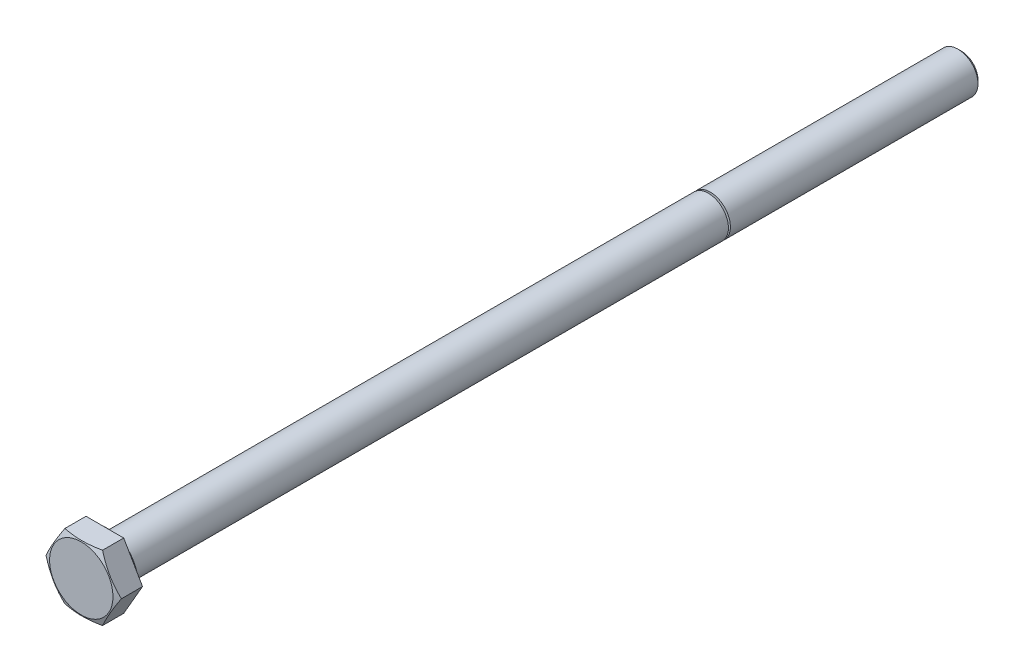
ISO-10303-21;
HEADER;
FILE_DESCRIPTION(('STEP AP214'),'2;1');
FILE_NAME('part.step','',(''),(''),'','','');
FILE_SCHEMA(('AUTOMOTIVE_DESIGN { 1 0 10303 214 1 1 1 1 }'));
ENDSEC;
DATA;
#1=APPLICATION_CONTEXT('core data for automotive mechanical design processes');
#2=APPLICATION_PROTOCOL_DEFINITION('international standard','automotive_design',2000,#1);
#3=PRODUCT_CONTEXT('',#1,'mechanical');
#4=PRODUCT('Part','Part','',(#3));
#5=PRODUCT_RELATED_PRODUCT_CATEGORY('part','',(#4));
#6=PRODUCT_DEFINITION_FORMATION('','',#4);
#7=PRODUCT_DEFINITION_CONTEXT('part definition',#1,'design');
#8=PRODUCT_DEFINITION('design','',#6,#7);
#9=PRODUCT_DEFINITION_SHAPE('','',#8);
#10=(LENGTH_UNIT() NAMED_UNIT(*) SI_UNIT(.MILLI.,.METRE.));
#11=(NAMED_UNIT(*) PLANE_ANGLE_UNIT() SI_UNIT($,.RADIAN.));
#12=(NAMED_UNIT(*) SI_UNIT($,.STERADIAN.) SOLID_ANGLE_UNIT());
#13=UNCERTAINTY_MEASURE_WITH_UNIT(LENGTH_MEASURE(1.E-05),#10,'distance_accuracy_value','');
#14=(GEOMETRIC_REPRESENTATION_CONTEXT(3) GLOBAL_UNCERTAINTY_ASSIGNED_CONTEXT((#13)) GLOBAL_UNIT_ASSIGNED_CONTEXT((#10,
#11,#12)) REPRESENTATION_CONTEXT('',''));
#15=CARTESIAN_POINT('',(0.,0.,0.));
#16=DIRECTION('',(0.,0.,1.));
#17=DIRECTION('',(1.,0.,0.));
#18=AXIS2_PLACEMENT_3D('',#15,#16,#17);
#19=CARTESIAN_POINT('',(0.,6.3,0.6));
#20=DIRECTION('',(0.,0.,1.));
#21=DIRECTION('',(1.,0.,0.));
#22=AXIS2_PLACEMENT_3D('',#19,#20,#21);
#23=PLANE('',#22);
#24=CARTESIAN_POINT('',(0.,0.,0.6));
#25=DIRECTION('',(0.,0.,1.));
#26=DIRECTION('',(1.,0.,0.));
#27=AXIS2_PLACEMENT_3D('',#24,#25,#26);
#28=CIRCLE('',#27,6.3);
#29=CARTESIAN_POINT('',(6.3,0.,0.6));
#30=VERTEX_POINT('',#29);
#31=EDGE_CURVE('E229',#30,#30,#28,.T.);
#32=ORIENTED_EDGE('',*,*,#31,.T.);
#33=EDGE_LOOP('',(#32));
#34=FACE_BOUND('',#33,.T.);
#35=DIRECTION('',(-1.,0.,0.));
#36=VECTOR('',#35,1.);
#37=CARTESIAN_POINT('',(0.,-6.49999696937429,0.6));
#38=LINE('',#37,#36);
#39=CARTESIAN_POINT('',(3.752775,-6.49999696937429,0.600000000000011));
#40=VERTEX_POINT('',#39);
#41=CARTESIAN_POINT('',(-3.752775,-6.4999969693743,0.6));
#42=VERTEX_POINT('',#41);
#43=EDGE_CURVE('E215',#40,#42,#38,.T.);
#44=ORIENTED_EDGE('',*,*,#43,.T.);
#45=DIRECTION('',(-0.5,0.866025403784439,0.));
#46=VECTOR('',#45,1.);
#47=CARTESIAN_POINT('',(-8.35714252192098,1.47500151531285,0.6));
#48=LINE('',#47,#46);
#49=CARTESIAN_POINT('',(-7.50555,0.,0.60000000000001));
#50=VERTEX_POINT('',#49);
#51=EDGE_CURVE('E84',#42,#50,#48,.T.);
#52=ORIENTED_EDGE('',*,*,#51,.T.);
#53=DIRECTION('',(0.5,0.866025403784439,0.));
#54=VECTOR('',#53,1.);
#55=CARTESIAN_POINT('',(-2.90118247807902,7.97499848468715,0.6));
#56=LINE('',#55,#54);
#57=CARTESIAN_POINT('',(-3.752775,6.49999696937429,0.600000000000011));
#58=VERTEX_POINT('',#57);
#59=EDGE_CURVE('E223',#50,#58,#56,.T.);
#60=ORIENTED_EDGE('',*,*,#59,.T.);
#61=DIRECTION('',(1.,0.,0.));
#62=VECTOR('',#61,1.);
#63=CARTESIAN_POINT('',(0.,6.4999969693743,0.6));
#64=LINE('',#63,#62);
#65=CARTESIAN_POINT('',(3.752775,6.4999969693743,0.600000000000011));
#66=VERTEX_POINT('',#65);
#67=EDGE_CURVE('E220',#58,#66,#64,.T.);
#68=ORIENTED_EDGE('',*,*,#67,.T.);
#69=DIRECTION('',(0.5,-0.866025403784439,0.));
#70=VECTOR('',#69,1.);
#71=CARTESIAN_POINT('',(2.90118247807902,7.97499848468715,0.6));
#72=LINE('',#71,#70);
#73=CARTESIAN_POINT('',(7.50555,0.,0.600000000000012));
#74=VERTEX_POINT('',#73);
#75=EDGE_CURVE('E218',#66,#74,#72,.T.);
#76=ORIENTED_EDGE('',*,*,#75,.T.);
#77=DIRECTION('',(-0.5,-0.866025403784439,0.));
#78=VECTOR('',#77,1.);
#79=CARTESIAN_POINT('',(8.35714252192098,1.47500151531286,0.6));
#80=LINE('',#79,#78);
#81=EDGE_CURVE('E203',#74,#40,#80,.T.);
#82=ORIENTED_EDGE('',*,*,#81,.T.);
#83=EDGE_LOOP('',(#44,#52,#60,#68,#76,#82));
#84=FACE_BOUND('',#83,.T.);
#85=ADVANCED_FACE('F17',(#34,#84),#23,.F.);
#86=CARTESIAN_POINT('',(0.,0.,-170.));
#87=DIRECTION('',(0.,0.,1.));
#88=DIRECTION('',(1.,0.,0.));
#89=AXIS2_PLACEMENT_3D('',#86,#87,#88);
#90=PLANE('',#89);
#91=CARTESIAN_POINT('',(0.,0.,-170.));
#92=DIRECTION('',(0.,0.,1.));
#93=DIRECTION('',(1.,0.,0.));
#94=AXIS2_PLACEMENT_3D('',#91,#92,#93);
#95=CIRCLE('',#94,3.3234375);
#96=CARTESIAN_POINT('',(3.32343750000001,0.,-170.));
#97=VERTEX_POINT('',#96);
#98=EDGE_CURVE('E77',#97,#97,#95,.T.);
#99=ORIENTED_EDGE('',*,*,#98,.F.);
#100=EDGE_LOOP('',(#99));
#101=FACE_BOUND('',#100,.T.);
#102=ADVANCED_FACE('F19',(#101),#90,.F.);
#103=CARTESIAN_POINT('',(0.,0.,-170.));
#104=DIRECTION('',(0.,0.,1.));
#105=DIRECTION('',(1.,0.,0.));
#106=AXIS2_PLACEMENT_3D('',#103,#104,#105);
#107=CONICAL_SURFACE('',#106,3.3234375,0.785398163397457);
#108=CARTESIAN_POINT('',(0.,0.,-169.3234375));
#109=DIRECTION('',(0.,0.,1.));
#110=DIRECTION('',(1.,0.,0.));
#111=AXIS2_PLACEMENT_3D('',#108,#109,#110);
#112=CIRCLE('',#111,4.);
#113=CARTESIAN_POINT('',(4.00000000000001,0.,-169.3234375));
#114=VERTEX_POINT('',#113);
#115=EDGE_CURVE('E173',#114,#114,#112,.T.);
#116=ORIENTED_EDGE('',*,*,#115,.F.);
#117=EDGE_LOOP('',(#116));
#118=FACE_BOUND('',#117,.T.);
#119=ORIENTED_EDGE('',*,*,#98,.T.);
#120=EDGE_LOOP('',(#119));
#121=FACE_BOUND('',#120,.T.);
#122=ADVANCED_FACE('F135',(#118,#121),#107,.T.);
#123=CARTESIAN_POINT('',(0.,0.,5.3));
#124=DIRECTION('',(0.,0.,1.));
#125=DIRECTION('',(1.,0.,0.));
#126=AXIS2_PLACEMENT_3D('',#123,#124,#125);
#127=CYLINDRICAL_SURFACE('',#126,4.);
#128=CARTESIAN_POINT('',(0.,0.,-120.));
#129=DIRECTION('',(0.,0.,1.));
#130=DIRECTION('',(1.,0.,0.));
#131=AXIS2_PLACEMENT_3D('',#128,#129,#130);
#132=CIRCLE('',#131,4.);
#133=CARTESIAN_POINT('',(4.00000000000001,0.,-120.));
#134=VERTEX_POINT('',#133);
#135=EDGE_CURVE('E177',#134,#134,#132,.T.);
#136=ORIENTED_EDGE('',*,*,#135,.F.);
#137=EDGE_LOOP('',(#136));
#138=FACE_BOUND('',#137,.T.);
#139=ORIENTED_EDGE('',*,*,#115,.T.);
#140=EDGE_LOOP('',(#139));
#141=FACE_BOUND('',#140,.T.);
#142=ADVANCED_FACE('F162',(#138,#141),#127,.T.);
#143=CARTESIAN_POINT('',(0.,4.,-120.));
#144=DIRECTION('',(0.,0.,-1.));
#145=DIRECTION('',(-1.,0.,0.));
#146=AXIS2_PLACEMENT_3D('',#143,#144,#145);
#147=PLANE('',#146);
#148=CARTESIAN_POINT('',(0.,0.,-120.));
#149=DIRECTION('',(0.,0.,1.));
#150=DIRECTION('',(1.,0.,0.));
#151=AXIS2_PLACEMENT_3D('',#148,#149,#150);
#152=CIRCLE('',#151,3.3234375);
#153=CARTESIAN_POINT('',(3.32343750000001,0.,-120.));
#154=VERTEX_POINT('',#153);
#155=EDGE_CURVE('E243',#154,#154,#152,.T.);
#156=ORIENTED_EDGE('',*,*,#155,.F.);
#157=EDGE_LOOP('',(#156));
#158=FACE_BOUND('',#157,.T.);
#159=ORIENTED_EDGE('',*,*,#135,.T.);
#160=EDGE_LOOP('',(#159));
#161=FACE_BOUND('',#160,.T.);
#162=ADVANCED_FACE('F158',(#158,#161),#147,.F.);
#163=CARTESIAN_POINT('',(0.,0.,-120.));
#164=DIRECTION('',(0.,0.,1.));
#165=DIRECTION('',(1.,0.,0.));
#166=AXIS2_PLACEMENT_3D('',#163,#164,#165);
#167=CONICAL_SURFACE('',#166,3.3234375,1.04719755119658);
#168=CARTESIAN_POINT('',(0.,0.,-119.609386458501));
#169=DIRECTION('',(0.,0.,1.));
#170=DIRECTION('',(1.,0.,0.));
#171=AXIS2_PLACEMENT_3D('',#168,#169,#170);
#172=CIRCLE('',#171,4.);
#173=CARTESIAN_POINT('',(4.00000000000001,0.,-119.609386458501));
#174=VERTEX_POINT('',#173);
#175=EDGE_CURVE('E240',#174,#174,#172,.T.);
#176=ORIENTED_EDGE('',*,*,#175,.F.);
#177=EDGE_LOOP('',(#176));
#178=FACE_BOUND('',#177,.T.);
#179=ORIENTED_EDGE('',*,*,#155,.T.);
#180=EDGE_LOOP('',(#179));
#181=FACE_BOUND('',#180,.T.);
#182=ADVANCED_FACE('F154',(#178,#181),#167,.T.);
#183=CARTESIAN_POINT('',(0.,0.,5.3));
#184=DIRECTION('',(0.,0.,1.));
#185=DIRECTION('',(1.,0.,0.));
#186=AXIS2_PLACEMENT_3D('',#183,#184,#185);
#187=CYLINDRICAL_SURFACE('',#186,4.);
#188=CARTESIAN_POINT('',(0.,0.,-0.4));
#189=DIRECTION('',(0.,0.,1.));
#190=DIRECTION('',(1.,0.,0.));
#191=AXIS2_PLACEMENT_3D('',#188,#189,#190);
#192=CIRCLE('',#191,4.);
#193=CARTESIAN_POINT('',(4.,0.,-0.4));
#194=VERTEX_POINT('',#193);
#195=EDGE_CURVE('E237',#194,#194,#192,.T.);
#196=ORIENTED_EDGE('',*,*,#195,.F.);
#197=EDGE_LOOP('',(#196));
#198=FACE_BOUND('',#197,.T.);
#199=ORIENTED_EDGE('',*,*,#175,.T.);
#200=EDGE_LOOP('',(#199));
#201=FACE_BOUND('',#200,.T.);
#202=ADVANCED_FACE('F150',(#198,#201),#187,.T.);
#203=CARTESIAN_POINT('',(0.,0.,-0.4));
#204=DIRECTION('',(0.,0.,1.));
#205=DIRECTION('',(1.,0.,0.));
#206=AXIS2_PLACEMENT_3D('',#203,#204,#205);
#207=TOROIDAL_SURFACE('',#206,4.4,0.4);
#208=ORIENTED_EDGE('',*,*,#195,.T.);
#209=EDGE_LOOP('',(#208));
#210=FACE_BOUND('',#209,.T.);
#211=CARTESIAN_POINT('',(0.,0.,0.));
#212=DIRECTION('',(0.,0.,1.));
#213=DIRECTION('',(1.,0.,0.));
#214=AXIS2_PLACEMENT_3D('',#211,#212,#213);
#215=CIRCLE('',#214,4.4);
#216=CARTESIAN_POINT('',(4.4,0.,0.));
#217=VERTEX_POINT('',#216);
#218=EDGE_CURVE('E234',#217,#217,#215,.T.);
#219=ORIENTED_EDGE('',*,*,#218,.F.);
#220=EDGE_LOOP('',(#219));
#221=FACE_BOUND('',#220,.T.);
#222=ADVANCED_FACE('F146',(#210,#221),#207,.F.);
#223=CARTESIAN_POINT('',(0.,4.4,0.));
#224=DIRECTION('',(0.,0.,1.));
#225=DIRECTION('',(1.,0.,0.));
#226=AXIS2_PLACEMENT_3D('',#223,#224,#225);
#227=PLANE('',#226);
#228=CARTESIAN_POINT('',(0.,0.,0.));
#229=DIRECTION('',(0.,0.,1.));
#230=DIRECTION('',(1.,0.,0.));
#231=AXIS2_PLACEMENT_3D('',#228,#229,#230);
#232=CIRCLE('',#231,5.7);
#233=CARTESIAN_POINT('',(5.7,0.,0.));
#234=VERTEX_POINT('',#233);
#235=EDGE_CURVE('E231',#234,#234,#232,.T.);
#236=ORIENTED_EDGE('',*,*,#235,.F.);
#237=EDGE_LOOP('',(#236));
#238=FACE_BOUND('',#237,.T.);
#239=ORIENTED_EDGE('',*,*,#218,.T.);
#240=EDGE_LOOP('',(#239));
#241=FACE_BOUND('',#240,.T.);
#242=ADVANCED_FACE('F142',(#238,#241),#227,.F.);
#243=CARTESIAN_POINT('',(0.,0.,0.6));
#244=DIRECTION('',(0.,0.,1.));
#245=DIRECTION('',(1.,0.,0.));
#246=AXIS2_PLACEMENT_3D('',#243,#244,#245);
#247=TOROIDAL_SURFACE('',#246,5.7,0.6);
#248=ORIENTED_EDGE('',*,*,#31,.F.);
#249=EDGE_LOOP('',(#248));
#250=FACE_BOUND('',#249,.T.);
#251=ORIENTED_EDGE('',*,*,#235,.T.);
#252=EDGE_LOOP('',(#251));
#253=FACE_BOUND('',#252,.T.);
#254=ADVANCED_FACE('F117',(#250,#253),#247,.T.);
#255=CARTESIAN_POINT('',(-3.752775,-6.4999969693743,-170.));
#256=DIRECTION('',(0.866025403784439,0.5,0.));
#257=DIRECTION('',(0.5,-0.866025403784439,0.));
#258=AXIS2_PLACEMENT_3D('',#255,#256,#257);
#259=PLANE('',#258);
#260=ORIENTED_EDGE('',*,*,#51,.F.);
#261=DIRECTION('',(0.,0.,1.));
#262=VECTOR('',#261,1.);
#263=CARTESIAN_POINT('',(-3.752775,-6.4999969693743,-170.));
#264=LINE('',#263,#262);
#265=CARTESIAN_POINT('',(-3.752775,-6.4999969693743,4.81818181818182));
#266=VERTEX_POINT('',#265);
#267=EDGE_CURVE('E37',#42,#266,#264,.T.);
#268=ORIENTED_EDGE('',*,*,#267,.T.);
#269=CARTESIAN_POINT('',(-7.50555011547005,2.E-07,4.81818177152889));
#270=CARTESIAN_POINT('',(-7.37443828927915,-0.227092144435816,4.87115743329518));
#271=CARTESIAN_POINT('',(-7.24289371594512,-0.454934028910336,4.92014195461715));
#272=CARTESIAN_POINT('',(-6.9789347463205,-0.912124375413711,5.00862317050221));
#273=CARTESIAN_POINT('',(-6.84651988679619,-1.14147363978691,5.04811430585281));
#274=CARTESIAN_POINT('',(-6.58100882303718,-1.60135229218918,5.11602763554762));
#275=CARTESIAN_POINT('',(-6.44791283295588,-1.83188130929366,5.14445311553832));
#276=CARTESIAN_POINT('',(-6.18122645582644,-2.29379566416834,5.18891785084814));
#277=CARTESIAN_POINT('',(-6.04763618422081,-2.52518080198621,5.20495983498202));
#278=CARTESIAN_POINT('',(-5.78248936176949,-2.98442856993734,5.22365999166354));
#279=CARTESIAN_POINT('',(-5.65093679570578,-3.21228429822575,5.22654079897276));
#280=CARTESIAN_POINT('',(-5.3879094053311,-3.66786110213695,5.21936907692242));
#281=CARTESIAN_POINT('',(-5.25643458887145,-3.89558216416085,5.20931541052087));
#282=CARTESIAN_POINT('',(-4.99395979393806,-4.35020184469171,5.17681520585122));
#283=CARTESIAN_POINT('',(-4.86295956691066,-4.57710089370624,5.15437654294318));
#284=CARTESIAN_POINT('',(-4.60158457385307,-5.02981566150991,5.09819377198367));
#285=CARTESIAN_POINT('',(-4.47120974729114,-5.2556314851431,5.06445078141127));
#286=CARTESIAN_POINT('',(-4.29203841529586,-5.56596533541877,5.01111287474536));
#287=CARTESIAN_POINT('',(-4.2429154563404,-5.65104879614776,4.99576396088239));
#288=CARTESIAN_POINT('',(-4.14478547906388,-5.82101490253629,4.96372954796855));
#289=CARTESIAN_POINT('',(-4.09577844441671,-5.90589757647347,4.94704425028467));
#290=CARTESIAN_POINT('',(-3.99770849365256,-6.07575971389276,4.91235486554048));
#291=CARTESIAN_POINT('',(-3.94864596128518,-6.16073851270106,4.8943464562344));
#292=CARTESIAN_POINT('',(-3.85062839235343,-6.33050992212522,4.8571379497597));
#293=CARTESIAN_POINT('',(-3.80167336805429,-6.4153025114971,4.83793772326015));
#294=CARTESIAN_POINT('',(-3.75277488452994,-6.4999971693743,4.81818177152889));
#295=B_SPLINE_CURVE_WITH_KNOTS('',3,(#269,#270,#271,#272,#273,#274,#275,#276,#277,#278,#279,
#280,#281,#282,#283,#284,#285,#286,#287,#288,#289,#290,#291,#292,#293,#294),.UNSPECIFIED.,.F.,
.F.,(4,2,2,2,2,2,2,2,2,2,2,2,4),(0.,0.802620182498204,1.60570923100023,2.40855964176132,
3.21123308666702,4.00027695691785,4.78939019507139,5.57800222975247,6.36653632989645,
6.66484369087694,6.96310618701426,7.26239050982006,7.56170736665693),.UNSPECIFIED.);
#296=CARTESIAN_POINT('',(-7.50555,0.,4.81818181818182));
#297=VERTEX_POINT('',#296);
#298=EDGE_CURVE('E11',#297,#266,#295,.T.);
#299=ORIENTED_EDGE('',*,*,#298,.F.);
#300=DIRECTION('',(0.,0.,1.));
#301=VECTOR('',#300,1.);
#302=CARTESIAN_POINT('',(-7.50555,0.,-170.));
#303=LINE('',#302,#301);
#304=EDGE_CURVE('E213',#50,#297,#303,.T.);
#305=ORIENTED_EDGE('',*,*,#304,.F.);
#306=EDGE_LOOP('',(#260,#268,#299,#305));
#307=FACE_BOUND('',#306,.T.);
#308=ADVANCED_FACE('F80',(#307),#259,.F.);
#309=CARTESIAN_POINT('',(-7.50555,0.,-170.));
#310=DIRECTION('',(0.866025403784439,-0.5,0.));
#311=DIRECTION('',(-0.5,-0.866025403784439,0.));
#312=AXIS2_PLACEMENT_3D('',#309,#310,#311);
#313=PLANE('',#312);
#314=ORIENTED_EDGE('',*,*,#59,.F.);
#315=ORIENTED_EDGE('',*,*,#304,.T.);
#316=CARTESIAN_POINT('',(-3.75277488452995,6.49999716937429,4.81818177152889));
#317=CARTESIAN_POINT('',(-3.88388671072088,6.27290482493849,4.87115743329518));
#318=CARTESIAN_POINT('',(-4.01543128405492,6.04506294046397,4.92014195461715));
#319=CARTESIAN_POINT('',(-4.27939025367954,5.5878725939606,5.00862317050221));
#320=CARTESIAN_POINT('',(-4.41180511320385,5.3585233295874,5.04811430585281));
#321=CARTESIAN_POINT('',(-4.67731617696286,4.89864467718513,5.11602763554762));
#322=CARTESIAN_POINT('',(-4.81041216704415,4.66811566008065,5.14445311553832));
#323=CARTESIAN_POINT('',(-5.0770985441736,4.20620130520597,5.18891785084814));
#324=CARTESIAN_POINT('',(-5.21068881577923,3.9748161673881,5.20495983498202));
#325=CARTESIAN_POINT('',(-5.47583563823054,3.51556839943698,5.22365999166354));
#326=CARTESIAN_POINT('',(-5.60738820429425,3.28771267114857,5.22654079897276));
#327=CARTESIAN_POINT('',(-5.87041559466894,2.83213586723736,5.21936907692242));
#328=CARTESIAN_POINT('',(-6.00189041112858,2.60441480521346,5.20931541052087));
#329=CARTESIAN_POINT('',(-6.26436520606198,2.14979512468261,5.17681520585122));
#330=CARTESIAN_POINT('',(-6.39536543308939,1.92289607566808,5.15437654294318));
#331=CARTESIAN_POINT('',(-6.65674042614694,1.4701813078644,5.09819377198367));
#332=CARTESIAN_POINT('',(-6.78711525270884,1.24436548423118,5.06445078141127));
#333=CARTESIAN_POINT('',(-6.96628658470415,0.934031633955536,5.01111287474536));
#334=CARTESIAN_POINT('',(-7.01540954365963,0.84894817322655,4.99576396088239));
#335=CARTESIAN_POINT('',(-7.11353952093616,0.678982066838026,4.96372954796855));
#336=CARTESIAN_POINT('',(-7.16254655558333,0.594099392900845,4.94704425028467));
#337=CARTESIAN_POINT('',(-7.26061650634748,0.424237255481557,4.91235486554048));
#338=CARTESIAN_POINT('',(-7.30967903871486,0.339258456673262,4.8943464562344));
#339=CARTESIAN_POINT('',(-7.4076966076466,0.169487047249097,4.8571379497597));
#340=CARTESIAN_POINT('',(-7.45665163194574,0.0846944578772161,4.83793772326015));
#341=CARTESIAN_POINT('',(-7.50555011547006,-1.99999999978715E-07,4.81818177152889));
#342=B_SPLINE_CURVE_WITH_KNOTS('',3,(#316,#317,#318,#319,#320,#321,#322,#323,#324,#325,#326,
#327,#328,#329,#330,#331,#332,#333,#334,#335,#336,#337,#338,#339,#340,#341),.UNSPECIFIED.,.F.,
.F.,(4,2,2,2,2,2,2,2,2,2,2,2,4),(0.,0.802620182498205,1.60570923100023,2.40855964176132,
3.21123308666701,4.00027695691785,4.78939019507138,5.57800222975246,6.36653632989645,
6.66484369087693,6.96310618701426,7.26239050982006,7.56170736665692),.UNSPECIFIED.);
#343=CARTESIAN_POINT('',(-3.752775,6.49999696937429,4.81818181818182));
#344=VERTEX_POINT('',#343);
#345=EDGE_CURVE('E30',#344,#297,#342,.T.);
#346=ORIENTED_EDGE('',*,*,#345,.F.);
#347=DIRECTION('',(0.,0.,1.));
#348=VECTOR('',#347,1.);
#349=CARTESIAN_POINT('',(-3.752775,6.49999696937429,-170.));
#350=LINE('',#349,#348);
#351=EDGE_CURVE('E208',#58,#344,#350,.T.);
#352=ORIENTED_EDGE('',*,*,#351,.F.);
#353=EDGE_LOOP('',(#314,#315,#346,#352));
#354=FACE_BOUND('',#353,.T.);
#355=ADVANCED_FACE('F109',(#354),#313,.F.);
#356=CARTESIAN_POINT('',(-3.752775,6.49999696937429,-170.));
#357=DIRECTION('',(0.,-1.,0.));
#358=DIRECTION('',(-1.,0.,0.));
#359=AXIS2_PLACEMENT_3D('',#356,#357,#358);
#360=PLANE('',#359);
#361=ORIENTED_EDGE('',*,*,#67,.F.);
#362=ORIENTED_EDGE('',*,*,#351,.T.);
#363=CARTESIAN_POINT('',(-10.2189559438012,6.49999696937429,2.95744755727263));
#364=CARTESIAN_POINT('',(-9.91517393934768,6.49999696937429,3.06097856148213));
#365=CARTESIAN_POINT('',(-9.61099699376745,6.49999696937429,3.16337208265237));
#366=CARTESIAN_POINT('',(-9.00164011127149,6.49999696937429,3.36522758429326));
#367=CARTESIAN_POINT('',(-8.69646007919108,6.49999696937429,3.46468927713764));
#368=CARTESIAN_POINT('',(-8.08410791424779,6.49999696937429,3.66027084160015));
#369=CARTESIAN_POINT('',(-7.77693261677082,6.49999696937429,3.75638084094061));
#370=CARTESIAN_POINT('',(-7.16119626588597,6.49999696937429,3.94404451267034));
#371=CARTESIAN_POINT('',(-6.85263524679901,6.49999696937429,4.03559829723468));
#372=CARTESIAN_POINT('',(-6.23544979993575,6.49999696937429,4.21250589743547));
#373=CARTESIAN_POINT('',(-5.92683386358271,6.49999696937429,4.29788918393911));
#374=CARTESIAN_POINT('',(-5.30767413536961,6.49999696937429,4.46145753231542));
#375=CARTESIAN_POINT('',(-4.9971302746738,6.49999696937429,4.53964233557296));
#376=CARTESIAN_POINT('',(-4.37409806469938,6.49999696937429,4.686837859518));
#377=CARTESIAN_POINT('',(-4.06161131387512,6.49999696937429,4.75585528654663));
#378=CARTESIAN_POINT('',(-3.43432011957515,6.49999696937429,4.88245049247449));
#379=CARTESIAN_POINT('',(-3.11951588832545,6.49999696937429,4.94002930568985));
#380=CARTESIAN_POINT('',(-2.56247883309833,6.49999696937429,5.0291614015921));
#381=CARTESIAN_POINT('',(-2.32071751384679,6.49999696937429,5.06364877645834));
#382=CARTESIAN_POINT('',(-1.83603686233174,6.49999696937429,5.12328692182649));
#383=CARTESIAN_POINT('',(-1.59311756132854,6.49999696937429,5.14843794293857));
#384=CARTESIAN_POINT('',(-1.10655056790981,6.49999696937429,5.18840574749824));
#385=CARTESIAN_POINT('',(-0.862903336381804,6.49999696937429,5.20322806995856));
#386=CARTESIAN_POINT('',(-0.3751847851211,6.49999696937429,5.2219090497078));
#387=CARTESIAN_POINT('',(-0.131113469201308,6.49999696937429,5.22576780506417));
#388=CARTESIAN_POINT('',(0.357030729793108,6.49999696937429,5.22234236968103));
#389=CARTESIAN_POINT('',(0.601103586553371,6.49999696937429,5.21505448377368));
#390=CARTESIAN_POINT('',(1.08868087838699,6.49999696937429,5.18966361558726));
#391=CARTESIAN_POINT('',(1.33218530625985,6.49999696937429,5.17156049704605));
#392=CARTESIAN_POINT('',(1.81835999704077,6.49999696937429,5.12529953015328));
#393=CARTESIAN_POINT('',(2.06102972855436,6.49999696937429,5.09713616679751));
#394=CARTESIAN_POINT('',(2.54516109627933,6.49999696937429,5.03181140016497));
#395=CARTESIAN_POINT('',(2.78662262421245,6.4999969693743,4.99464920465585));
#396=CARTESIAN_POINT('',(3.34298104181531,6.4999969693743,4.89974655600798));
#397=CARTESIAN_POINT('',(3.65739707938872,6.49999696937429,4.83919947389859));
#398=CARTESIAN_POINT('',(4.28393227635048,6.49999696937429,4.70724199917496));
#399=CARTESIAN_POINT('',(4.59605124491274,6.49999696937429,4.63583071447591));
#400=CARTESIAN_POINT('',(5.21835286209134,6.49999696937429,4.48434129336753));
#401=CARTESIAN_POINT('',(5.52853428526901,6.49999696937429,4.40425816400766));
#402=CARTESIAN_POINT('',(6.14703474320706,6.49999696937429,4.2372827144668));
#403=CARTESIAN_POINT('',(6.45535384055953,6.49999696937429,4.15039062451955));
#404=CARTESIAN_POINT('',(7.07126517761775,6.49999696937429,3.97097813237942));
#405=CARTESIAN_POINT('',(7.37885306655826,6.49999696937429,3.87844286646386));
#406=CARTESIAN_POINT('',(7.99270470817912,6.49999696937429,3.6890712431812));
#407=CARTESIAN_POINT('',(8.29896843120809,6.49999696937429,3.59223479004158));
#408=CARTESIAN_POINT('',(8.90966004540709,6.49999696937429,3.39536162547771));
#409=CARTESIAN_POINT('',(9.21409056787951,6.49999696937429,3.2953330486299));
#410=CARTESIAN_POINT('',(9.8219941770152,6.49999696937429,3.09249187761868));
#411=CARTESIAN_POINT('',(10.1254673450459,6.4999969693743,2.98967952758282));
#412=CARTESIAN_POINT('',(10.4285624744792,6.4999969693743,2.88578331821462));
#413=B_SPLINE_CURVE_WITH_KNOTS('',3,(#363,#364,#365,#366,#367,#368,#369,#370,#371,#372,#373,
#374,#375,#376,#377,#378,#379,#380,#381,#382,#383,#384,#385,#386,#387,#388,#389,#390,#391,#392,
#393,#394,#395,#396,#397,#398,#399,#400,#401,#402,#403,#404,#405,#406,#407,#408,#409,#410,#411,
#412),.UNSPECIFIED.,.F.,.F.,(4,2,2,2,2,2,2,2,2,2,2,2,2,2,2,2,2,2,2,2,2,2,2,2,4),(0.,
0.962826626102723,1.92574739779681,2.89129888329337,3.85682658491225,4.8173874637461,
5.77798283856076,6.73787157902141,7.69767348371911,8.43014406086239,9.16259497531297,
9.89465279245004,10.6267040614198,11.3589980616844,12.0913012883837,12.8240065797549,
13.5567763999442,14.5171015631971,15.4775056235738,16.4384656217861,17.3993931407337,
18.3629712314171,19.3265707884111,20.2878850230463,21.2491152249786),.UNSPECIFIED.);
#414=CARTESIAN_POINT('',(3.752775,6.4999969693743,4.81818181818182));
#415=VERTEX_POINT('',#414);
#416=EDGE_CURVE('E91',#415,#344,#413,.F.);
#417=ORIENTED_EDGE('',*,*,#416,.F.);
#418=DIRECTION('',(0.,0.,1.));
#419=VECTOR('',#418,1.);
#420=CARTESIAN_POINT('',(3.752775,6.4999969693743,-170.));
#421=LINE('',#420,#419);
#422=EDGE_CURVE('E205',#66,#415,#421,.T.);
#423=ORIENTED_EDGE('',*,*,#422,.F.);
#424=EDGE_LOOP('',(#361,#362,#417,#423));
#425=FACE_BOUND('',#424,.T.);
#426=ADVANCED_FACE('F112',(#425),#360,.F.);
#427=CARTESIAN_POINT('',(3.752775,6.4999969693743,-170.));
#428=DIRECTION('',(-0.866025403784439,-0.5,0.));
#429=DIRECTION('',(-0.5,0.866025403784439,0.));
#430=AXIS2_PLACEMENT_3D('',#427,#428,#429);
#431=PLANE('',#430);
#432=ORIENTED_EDGE('',*,*,#75,.F.);
#433=ORIENTED_EDGE('',*,*,#422,.T.);
#434=CARTESIAN_POINT('',(7.50555011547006,-1.99999999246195E-07,4.81818177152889));
#435=CARTESIAN_POINT('',(7.37443828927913,0.227092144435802,4.87115743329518));
#436=CARTESIAN_POINT('',(7.24289371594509,0.454934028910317,4.92014195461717));
#437=CARTESIAN_POINT('',(6.97893474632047,0.912124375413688,5.00862317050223));
#438=CARTESIAN_POINT('',(6.84651988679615,1.14147363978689,5.04811430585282));
#439=CARTESIAN_POINT('',(6.58100882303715,1.60135229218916,5.11602763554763));
#440=CARTESIAN_POINT('',(6.44791283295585,1.83188130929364,5.14445311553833));
#441=CARTESIAN_POINT('',(6.18122645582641,2.29379566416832,5.18891785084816));
#442=CARTESIAN_POINT('',(6.04763618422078,2.52518080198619,5.20495983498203));
#443=CARTESIAN_POINT('',(5.78248936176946,2.98442856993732,5.22365999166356));
#444=CARTESIAN_POINT('',(5.65093679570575,3.21228429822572,5.22654079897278));
#445=CARTESIAN_POINT('',(5.38790940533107,3.66786110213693,5.21936907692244));
#446=CARTESIAN_POINT('',(5.25643458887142,3.89558216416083,5.20931541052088));
#447=CARTESIAN_POINT('',(4.99395979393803,4.35020184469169,5.17681520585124));
#448=CARTESIAN_POINT('',(4.86295956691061,4.57710089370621,5.1543765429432));
#449=CARTESIAN_POINT('',(4.60158457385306,5.0298156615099,5.09819377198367));
#450=CARTESIAN_POINT('',(4.47120974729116,5.25563148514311,5.06445078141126));
#451=CARTESIAN_POINT('',(4.29203841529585,5.56596533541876,5.01111287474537));
#452=CARTESIAN_POINT('',(4.24291545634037,5.65104879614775,4.9957639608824));
#453=CARTESIAN_POINT('',(4.14478547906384,5.82101490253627,4.96372954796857));
#454=CARTESIAN_POINT('',(4.09577844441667,5.90589757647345,4.94704425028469));
#455=CARTESIAN_POINT('',(3.99770849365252,6.07575971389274,4.91235486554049));
#456=CARTESIAN_POINT('',(3.94864596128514,6.16073851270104,4.89434645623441));
#457=CARTESIAN_POINT('',(3.8506283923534,6.3305099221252,4.85713794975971));
#458=CARTESIAN_POINT('',(3.80167336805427,6.41530251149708,4.83793772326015));
#459=CARTESIAN_POINT('',(3.75277488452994,6.4999971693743,4.81818177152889));
#460=B_SPLINE_CURVE_WITH_KNOTS('',3,(#434,#435,#436,#437,#438,#439,#440,#441,#442,#443,#444,
#445,#446,#447,#448,#449,#450,#451,#452,#453,#454,#455,#456,#457,#458,#459),.UNSPECIFIED.,.F.,
.F.,(4,2,2,2,2,2,2,2,2,2,2,2,4),(0.,0.802620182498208,1.60570923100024,2.40855964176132,
3.21123308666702,4.00027695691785,4.78939019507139,5.57800222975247,6.36653632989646,
6.66484369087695,6.96310618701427,7.26239050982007,7.56170736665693),.UNSPECIFIED.);
#461=CARTESIAN_POINT('',(7.50555,0.,4.81818181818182));
#462=VERTEX_POINT('',#461);
#463=EDGE_CURVE('E95',#462,#415,#460,.T.);
#464=ORIENTED_EDGE('',*,*,#463,.F.);
#465=DIRECTION('',(0.,0.,1.));
#466=VECTOR('',#465,1.);
#467=CARTESIAN_POINT('',(7.50555,0.,-170.));
#468=LINE('',#467,#466);
#469=EDGE_CURVE('E202',#74,#462,#468,.T.);
#470=ORIENTED_EDGE('',*,*,#469,.F.);
#471=EDGE_LOOP('',(#432,#433,#464,#470));
#472=FACE_BOUND('',#471,.T.);
#473=ADVANCED_FACE('F191',(#472),#431,.F.);
#474=CARTESIAN_POINT('',(7.50555,0.,-170.));
#475=DIRECTION('',(-0.866025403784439,0.5,0.));
#476=DIRECTION('',(0.5,0.866025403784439,0.));
#477=AXIS2_PLACEMENT_3D('',#474,#475,#476);
#478=PLANE('',#477);
#479=ORIENTED_EDGE('',*,*,#81,.F.);
#480=ORIENTED_EDGE('',*,*,#469,.T.);
#481=CARTESIAN_POINT('',(3.75277488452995,-6.49999716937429,4.81818177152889));
#482=CARTESIAN_POINT('',(3.88388671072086,-6.27290482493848,4.87115743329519));
#483=CARTESIAN_POINT('',(4.01543128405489,-6.04506294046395,4.92014195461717));
#484=CARTESIAN_POINT('',(4.2793902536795,-5.58787259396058,5.00862317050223));
#485=CARTESIAN_POINT('',(4.41180511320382,-5.35852332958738,5.04811430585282));
#486=CARTESIAN_POINT('',(4.67731617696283,-4.89864467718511,5.11602763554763));
#487=CARTESIAN_POINT('',(4.81041216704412,-4.66811566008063,5.14445311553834));
#488=CARTESIAN_POINT('',(5.07709854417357,-4.20620130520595,5.18891785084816));
#489=CARTESIAN_POINT('',(5.21068881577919,-3.97481616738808,5.20495983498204));
#490=CARTESIAN_POINT('',(5.47583563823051,-3.51556839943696,5.22365999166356));
#491=CARTESIAN_POINT('',(5.60738820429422,-3.28771267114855,5.22654079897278));
#492=CARTESIAN_POINT('',(5.8704155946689,-2.83213586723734,5.21936907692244));
#493=CARTESIAN_POINT('',(6.00189041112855,-2.60441480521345,5.20931541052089));
#494=CARTESIAN_POINT('',(6.26436520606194,-2.14979512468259,5.17681520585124));
#495=CARTESIAN_POINT('',(6.39536543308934,-1.92289607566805,5.15437654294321));
#496=CARTESIAN_POINT('',(6.65674042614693,-1.47018130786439,5.09819377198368));
#497=CARTESIAN_POINT('',(6.78711525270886,-1.24436548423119,5.06445078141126));
#498=CARTESIAN_POINT('',(6.96628658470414,-0.934031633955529,5.01111287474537));
#499=CARTESIAN_POINT('',(7.0154095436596,-0.848948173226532,4.9957639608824));
#500=CARTESIAN_POINT('',(7.11353952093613,-0.678982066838,4.96372954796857));
#501=CARTESIAN_POINT('',(7.16254655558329,-0.594099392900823,4.94704425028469));
#502=CARTESIAN_POINT('',(7.26061650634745,-0.424237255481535,4.91235486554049));
#503=CARTESIAN_POINT('',(7.30967903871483,-0.339258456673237,4.89434645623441));
#504=CARTESIAN_POINT('',(7.40769660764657,-0.169487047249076,4.85713794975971));
#505=CARTESIAN_POINT('',(7.45665163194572,-0.0846944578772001,4.83793772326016));
#506=CARTESIAN_POINT('',(7.50555011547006,2.00000001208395E-07,4.81818177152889));
#507=B_SPLINE_CURVE_WITH_KNOTS('',3,(#481,#482,#483,#484,#485,#486,#487,#488,#489,#490,#491,
#492,#493,#494,#495,#496,#497,#498,#499,#500,#501,#502,#503,#504,#505,#506),.UNSPECIFIED.,.F.,
.F.,(4,2,2,2,2,2,2,2,2,2,2,2,4),(0.,0.802620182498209,1.60570923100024,2.40855964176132,
3.21123308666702,4.00027695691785,4.78939019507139,5.57800222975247,6.36653632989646,
6.66484369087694,6.96310618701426,7.26239050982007,7.56170736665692),.UNSPECIFIED.);
#508=CARTESIAN_POINT('',(3.752775,-6.49999696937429,4.81818181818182));
#509=VERTEX_POINT('',#508);
#510=EDGE_CURVE('E76',#509,#462,#507,.T.);
#511=ORIENTED_EDGE('',*,*,#510,.F.);
#512=DIRECTION('',(0.,0.,1.));
#513=VECTOR('',#512,1.);
#514=CARTESIAN_POINT('',(3.752775,-6.49999696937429,-170.));
#515=LINE('',#514,#513);
#516=EDGE_CURVE('E42',#40,#509,#515,.T.);
#517=ORIENTED_EDGE('',*,*,#516,.F.);
#518=EDGE_LOOP('',(#479,#480,#511,#517));
#519=FACE_BOUND('',#518,.T.);
#520=ADVANCED_FACE('F127',(#519),#478,.F.);
#521=CARTESIAN_POINT('',(3.752775,-6.49999696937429,-170.));
#522=DIRECTION('',(0.,1.,0.));
#523=DIRECTION('',(1.,0.,0.));
#524=AXIS2_PLACEMENT_3D('',#521,#522,#523);
#525=PLANE('',#524);
#526=ORIENTED_EDGE('',*,*,#43,.F.);
#527=ORIENTED_EDGE('',*,*,#516,.T.);
#528=CARTESIAN_POINT('',(-10.2189559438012,-6.4999969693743,2.95744755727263));
#529=CARTESIAN_POINT('',(-9.91517393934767,-6.4999969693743,3.06097856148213));
#530=CARTESIAN_POINT('',(-9.61099699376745,-6.4999969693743,3.16337208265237));
#531=CARTESIAN_POINT('',(-9.00164011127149,-6.4999969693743,3.36522758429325));
#532=CARTESIAN_POINT('',(-8.69646007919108,-6.4999969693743,3.46468927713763));
#533=CARTESIAN_POINT('',(-8.08410791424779,-6.4999969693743,3.66027084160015));
#534=CARTESIAN_POINT('',(-7.77693261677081,-6.4999969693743,3.75638084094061));
#535=CARTESIAN_POINT('',(-7.16119626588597,-6.4999969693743,3.94404451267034));
#536=CARTESIAN_POINT('',(-6.85263524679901,-6.4999969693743,4.03559829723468));
#537=CARTESIAN_POINT('',(-6.23544979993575,-6.4999969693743,4.21250589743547));
#538=CARTESIAN_POINT('',(-5.9268338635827,-6.49999696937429,4.29788918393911));
#539=CARTESIAN_POINT('',(-5.30767413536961,-6.49999696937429,4.46145753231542));
#540=CARTESIAN_POINT('',(-4.9971302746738,-6.4999969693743,4.53964233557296));
#541=CARTESIAN_POINT('',(-4.37409806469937,-6.49999696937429,4.686837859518));
#542=CARTESIAN_POINT('',(-4.06161131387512,-6.49999696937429,4.75585528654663));
#543=CARTESIAN_POINT('',(-3.43432011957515,-6.4999969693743,4.88245049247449));
#544=CARTESIAN_POINT('',(-3.11951588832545,-6.4999969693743,4.94002930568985));
#545=CARTESIAN_POINT('',(-2.56247883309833,-6.4999969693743,5.0291614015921));
#546=CARTESIAN_POINT('',(-2.32071751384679,-6.49999696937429,5.06364877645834));
#547=CARTESIAN_POINT('',(-1.83603686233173,-6.49999696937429,5.12328692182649));
#548=CARTESIAN_POINT('',(-1.59311756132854,-6.49999696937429,5.14843794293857));
#549=CARTESIAN_POINT('',(-1.1065505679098,-6.49999696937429,5.18840574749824));
#550=CARTESIAN_POINT('',(-0.862903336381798,-6.49999696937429,5.20322806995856));
#551=CARTESIAN_POINT('',(-0.375184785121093,-6.49999696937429,5.2219090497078));
#552=CARTESIAN_POINT('',(-0.131113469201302,-6.49999696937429,5.22576780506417));
#553=CARTESIAN_POINT('',(0.357030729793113,-6.49999696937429,5.22234236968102));
#554=CARTESIAN_POINT('',(0.601103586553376,-6.49999696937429,5.21505448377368));
#555=CARTESIAN_POINT('',(1.088680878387,-6.49999696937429,5.18966361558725));
#556=CARTESIAN_POINT('',(1.33218530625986,-6.49999696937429,5.17156049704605));
#557=CARTESIAN_POINT('',(1.81835999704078,-6.49999696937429,5.12529953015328));
#558=CARTESIAN_POINT('',(2.06102972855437,-6.49999696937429,5.09713616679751));
#559=CARTESIAN_POINT('',(2.54516109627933,-6.49999696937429,5.03181140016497));
#560=CARTESIAN_POINT('',(2.78662262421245,-6.49999696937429,4.99464920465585));
#561=CARTESIAN_POINT('',(3.34298104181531,-6.49999696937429,4.89974655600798));
#562=CARTESIAN_POINT('',(3.65739707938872,-6.49999696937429,4.83919947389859));
#563=CARTESIAN_POINT('',(4.28393227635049,-6.49999696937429,4.70724199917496));
#564=CARTESIAN_POINT('',(4.59605124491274,-6.49999696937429,4.63583071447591));
#565=CARTESIAN_POINT('',(5.21835286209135,-6.49999696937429,4.48434129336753));
#566=CARTESIAN_POINT('',(5.52853428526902,-6.49999696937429,4.40425816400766));
#567=CARTESIAN_POINT('',(6.14703474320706,-6.49999696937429,4.2372827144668));
#568=CARTESIAN_POINT('',(6.45535384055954,-6.49999696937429,4.15039062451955));
#569=CARTESIAN_POINT('',(7.07126517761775,-6.49999696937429,3.97097813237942));
#570=CARTESIAN_POINT('',(7.37885306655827,-6.49999696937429,3.87844286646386));
#571=CARTESIAN_POINT('',(7.99270470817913,-6.49999696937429,3.6890712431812));
#572=CARTESIAN_POINT('',(8.29896843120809,-6.49999696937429,3.59223479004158));
#573=CARTESIAN_POINT('',(8.9096600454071,-6.49999696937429,3.39536162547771));
#574=CARTESIAN_POINT('',(9.21409056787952,-6.49999696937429,3.2953330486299));
#575=CARTESIAN_POINT('',(9.8219941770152,-6.49999696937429,3.09249187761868));
#576=CARTESIAN_POINT('',(10.1254673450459,-6.49999696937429,2.98967952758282));
#577=CARTESIAN_POINT('',(10.4285624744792,-6.49999696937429,2.88578331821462));
#578=B_SPLINE_CURVE_WITH_KNOTS('',3,(#528,#529,#530,#531,#532,#533,#534,#535,#536,#537,#538,
#539,#540,#541,#542,#543,#544,#545,#546,#547,#548,#549,#550,#551,#552,#553,#554,#555,#556,#557,
#558,#559,#560,#561,#562,#563,#564,#565,#566,#567,#568,#569,#570,#571,#572,#573,#574,#575,#576,
#577),.UNSPECIFIED.,.F.,.F.,(4,2,2,2,2,2,2,2,2,2,2,2,2,2,2,2,2,2,2,2,2,2,2,2,4),(0.,
0.962826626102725,1.92574739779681,2.89129888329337,3.85682658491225,4.8173874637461,
5.77798283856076,6.73787157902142,7.69767348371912,8.4301440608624,9.16259497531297,
9.89465279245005,10.6267040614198,11.3589980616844,12.0913012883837,12.8240065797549,
13.5567763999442,14.5171015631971,15.4775056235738,16.4384656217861,17.3993931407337,
18.3629712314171,19.3265707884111,20.2878850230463,21.2491152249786),.UNSPECIFIED.);
#579=EDGE_CURVE('E72',#266,#509,#578,.T.);
#580=ORIENTED_EDGE('',*,*,#579,.F.);
#581=ORIENTED_EDGE('',*,*,#267,.F.);
#582=EDGE_LOOP('',(#526,#527,#580,#581));
#583=FACE_BOUND('',#582,.T.);
#584=ADVANCED_FACE('F73',(#583),#525,.F.);
#585=CARTESIAN_POINT('',(0.,6.31300815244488,5.3));
#586=DIRECTION('',(0.,0.,-1.));
#587=DIRECTION('',(-1.,0.,0.));
#588=AXIS2_PLACEMENT_3D('',#585,#586,#587);
#589=PLANE('',#588);
#590=CARTESIAN_POINT('',(0.,0.,5.3));
#591=DIRECTION('',(0.,0.,1.));
#592=DIRECTION('',(1.,0.,0.));
#593=AXIS2_PLACEMENT_3D('',#590,#591,#592);
#594=CIRCLE('',#593,6.31300815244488);
#595=CARTESIAN_POINT('',(6.31300815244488,0.,5.3));
#596=VERTEX_POINT('',#595);
#597=EDGE_CURVE('E227',#596,#596,#594,.T.);
#598=ORIENTED_EDGE('',*,*,#597,.T.);
#599=EDGE_LOOP('',(#598));
#600=FACE_BOUND('',#599,.T.);
#601=ADVANCED_FACE('F118',(#600),#589,.F.);
#602=CARTESIAN_POINT('',(0.,0.,4.81818181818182));
#603=DIRECTION('',(0.,0.,-1.));
#604=DIRECTION('',(-1.,0.,0.));
#605=AXIS2_PLACEMENT_3D('',#602,#603,#604);
#606=CONICAL_SURFACE('',#605,7.50555,1.18682389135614);
#607=ORIENTED_EDGE('',*,*,#597,.F.);
#608=EDGE_LOOP('',(#607));
#609=FACE_BOUND('',#608,.T.);
#610=ORIENTED_EDGE('',*,*,#345,.T.);
#611=ORIENTED_EDGE('',*,*,#298,.T.);
#612=ORIENTED_EDGE('',*,*,#579,.T.);
#613=ORIENTED_EDGE('',*,*,#510,.T.);
#614=ORIENTED_EDGE('',*,*,#463,.T.);
#615=ORIENTED_EDGE('',*,*,#416,.T.);
#616=EDGE_LOOP('',(#610,#611,#612,#613,#614,#615));
#617=FACE_BOUND('',#616,.T.);
#618=ADVANCED_FACE('F88',(#609,#617),#606,.T.);
#619=CLOSED_SHELL('',(#85,#102,#122,#142,#162,#182,#202,#222,#242,#254,#308,#355,#426,#473,#520,
#584,#601,#618));
#620=MANIFOLD_SOLID_BREP('B1',#619);
#621=ADVANCED_BREP_SHAPE_REPRESENTATION('',(#18,#620),#14);
#622=SHAPE_DEFINITION_REPRESENTATION(#9,#621);
ENDSEC;
END-ISO-10303-21;
